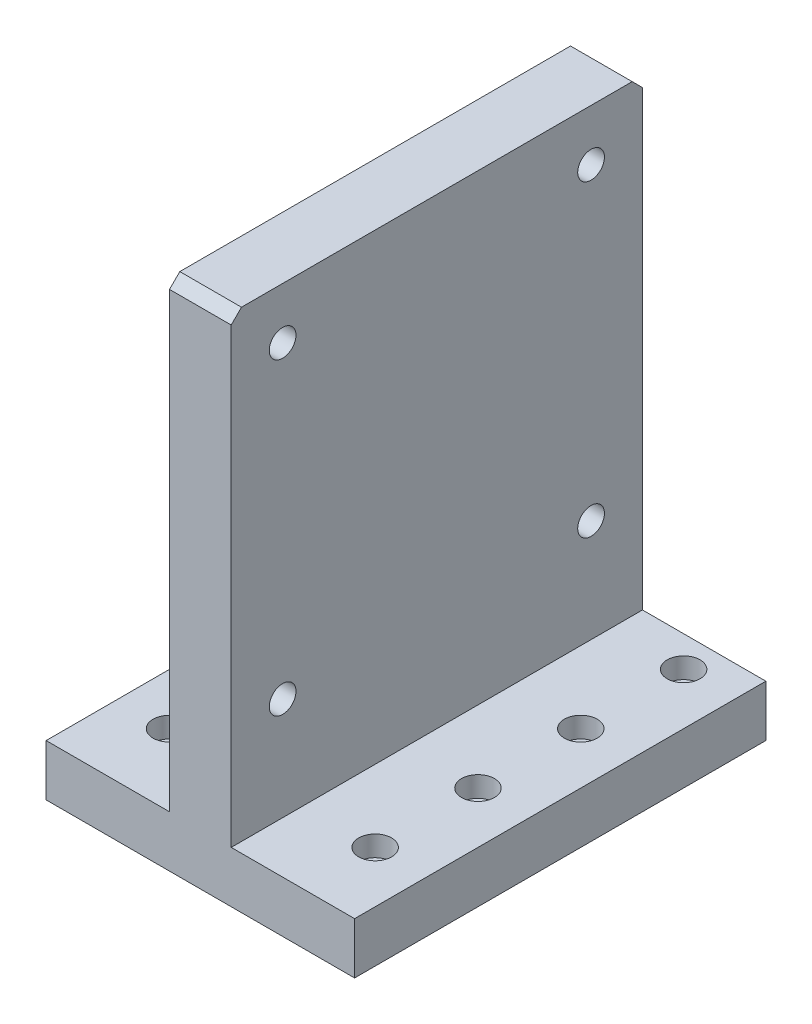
from build123d import *

# Parameters (mm, degrees)
BASE_EXTRUSION_DEPTH    = 200
ESQUISSE2_R             = 6.5
ENL_V_MAT_EXTRU_1_DEPTH = 100
CHANFREIN1_SIZE         = 5
ESQUISSE4_R             = 5
ENL_V_MAT_EXTRU_3_DEPTH = 30
ESQUISSE6_R             = 8
ENL_V_MAT_EXTRU_4_DEPTH = 10
ESQUISSE7_R             = 10
ENL_V_MAT_EXTRU_5_DEPTH = 20
ENL_V_MAT_EXTRU_6_DEPTH = 5


with BuildPart() as part:
    # Esquisse1 → Base-Extrusion (new body)
    with BuildSketch(Plane.XY):
        Polygon((-15, 250), (15, 250), (15, 25), (75, 25), (75, 0), (-75, 0), (-75, 25), (-15, 25), align=None)
    extrude(amount=BASE_EXTRUSION_DEPTH)

    # Esquisse2 → Enl_v. mat.-Extru.1 (cut, symmetric)
    with BuildSketch(Plane(origin=(0, 0, 0), x_dir=(0, 0, -1), z_dir=(1, 0, 0))):
        with Locations((-25, 225)):
            Circle(ESQUISSE2_R)
        with Locations((-175, 225)):
            Circle(ESQUISSE2_R)
        with Locations((-25, 75)):
            Circle(ESQUISSE2_R)
        with Locations((-175, 75)):
            Circle(ESQUISSE2_R)
    extrude(amount=ENL_V_MAT_EXTRU_1_DEPTH, both=True, mode=Mode.SUBTRACT)

    # Chanfrein1
    chanfrein1_edges = [part.edges().sort_by_distance(p)[0] for p in [
        (0, 250, 0),
        (0, 250, 200),
    ]]
    chamfer(chanfrein1_edges, length=CHANFREIN1_SIZE)

    # Esquisse4 → Enl_v. mat.-Extru.3 (cut)
    with BuildSketch(Plane(origin=(0, 0, 0), x_dir=(1, 0, 0), z_dir=(0, 1, 0))):
        with Locations(Location((-50, -15, 0), (0, 0, 180))):
            Circle(ESQUISSE4_R)
        with Locations(Location((-50, -65, 0), (0, 0, 180))):
            Circle(ESQUISSE4_R)
        with Locations(Location((-50, -115, 0), (0, 0, 180))):
            Circle(ESQUISSE4_R)
        with Locations(Location((-50, -165, 0), (0, 0, 180))):
            Circle(ESQUISSE4_R)
        with Locations(Location((50, -165, 0), (0, 0, 180))):
            Circle(ESQUISSE4_R)
        with Locations(Location((50, -115, 0), (0, 0, 180))):
            Circle(ESQUISSE4_R)
        with Locations(Location((50, -65, 0), (0, 0, 180))):
            Circle(ESQUISSE4_R)
        with Locations(Location((50, -15, 0), (0, 0, 180))):
            Circle(ESQUISSE4_R)
    extrude(amount=ENL_V_MAT_EXTRU_3_DEPTH, mode=Mode.SUBTRACT)

    # Esquisse6 → Enl_v. mat.-Extru.4 (cut)
    with BuildSketch(Plane(origin=(0, 25, 0), x_dir=(-1, 0, 0), z_dir=(0, 1, 0))):
        with Locations((-50, 165)):
            Circle(ESQUISSE6_R)
        with Locations((50, 165)):
            Circle(ESQUISSE6_R)
        with Locations((-50, 115)):
            Circle(ESQUISSE6_R)
        with Locations((50, 115)):
            Circle(ESQUISSE6_R)
        with Locations((-50, 65)):
            Circle(ESQUISSE6_R)
        with Locations((50, 65)):
            Circle(ESQUISSE6_R)
        with Locations((-50, 15)):
            Circle(ESQUISSE6_R)
        with Locations((50, 15)):
            Circle(ESQUISSE6_R)
    extrude(amount=-ENL_V_MAT_EXTRU_4_DEPTH, mode=Mode.SUBTRACT)

    # Esquisse7 → Enl_v. mat.-Extru.5 (cut)
    with BuildSketch(Plane(origin=(0, 0, 0), x_dir=(1, 0, 0), z_dir=(0, 1, 0))):
        with Locations(Location((0, -90, 0), (0, 0, 270))):
            Circle(ESQUISSE7_R)
    extrude(amount=ENL_V_MAT_EXTRU_5_DEPTH, mode=Mode.SUBTRACT)

    # Esquisse8 → Enl_v. mat.-Extru.6 (cut)
    with BuildSketch(Plane(origin=(0, 0, 0), x_dir=(1, 0, 0), z_dir=(0, 1, 0))):
        with BuildLine():
            Line((-10, 0), (-10, -30))
            ThreePointArc((-10, -30), (0, -40), (10, -30))
            Line((10, -30), (10, 0))
            Line((10, 0), (-10, 0))
        make_face()
    extrude(amount=ENL_V_MAT_EXTRU_6_DEPTH, mode=Mode.SUBTRACT)


solid = part.part
